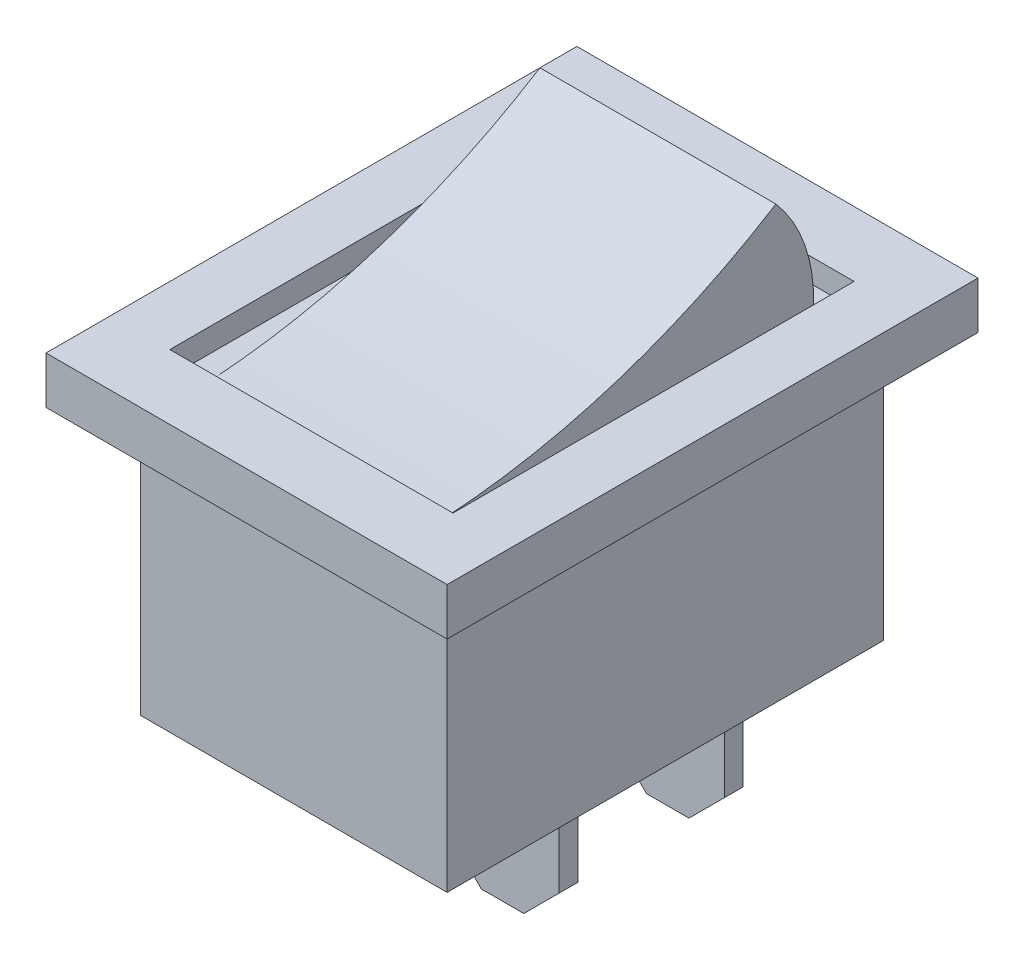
ISO-10303-21;
HEADER;
FILE_DESCRIPTION(('STEP AP214'),'2;1');
FILE_NAME('part.step','',(''),(''),'','','');
FILE_SCHEMA(('AUTOMOTIVE_DESIGN { 1 0 10303 214 1 1 1 1 }'));
ENDSEC;
DATA;
#1=APPLICATION_CONTEXT('core data for automotive mechanical design processes');
#2=APPLICATION_PROTOCOL_DEFINITION('international standard','automotive_design',2000,#1);
#3=PRODUCT_CONTEXT('',#1,'mechanical');
#4=PRODUCT('Part','Part','',(#3));
#5=PRODUCT_RELATED_PRODUCT_CATEGORY('part','',(#4));
#6=PRODUCT_DEFINITION_FORMATION('','',#4);
#7=PRODUCT_DEFINITION_CONTEXT('part definition',#1,'design');
#8=PRODUCT_DEFINITION('design','',#6,#7);
#9=PRODUCT_DEFINITION_SHAPE('','',#8);
#10=(LENGTH_UNIT() NAMED_UNIT(*) SI_UNIT(.MILLI.,.METRE.));
#11=(NAMED_UNIT(*) PLANE_ANGLE_UNIT() SI_UNIT($,.RADIAN.));
#12=(NAMED_UNIT(*) SI_UNIT($,.STERADIAN.) SOLID_ANGLE_UNIT());
#13=UNCERTAINTY_MEASURE_WITH_UNIT(LENGTH_MEASURE(1.E-05),#10,'distance_accuracy_value','');
#14=(GEOMETRIC_REPRESENTATION_CONTEXT(3) GLOBAL_UNCERTAINTY_ASSIGNED_CONTEXT((#13)) GLOBAL_UNIT_ASSIGNED_CONTEXT((#10,
#11,#12)) REPRESENTATION_CONTEXT('',''));
#15=CARTESIAN_POINT('',(0.,0.,0.));
#16=DIRECTION('',(0.,0.,1.));
#17=DIRECTION('',(1.,0.,0.));
#18=AXIS2_PLACEMENT_3D('',#15,#16,#17);
#19=CARTESIAN_POINT('',(-6.49999999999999,0.,9.25));
#20=DIRECTION('',(0.,-1.,0.));
#21=DIRECTION('',(0.,0.,-1.));
#22=AXIS2_PLACEMENT_3D('',#19,#20,#21);
#23=PLANE('',#22);
#24=DIRECTION('',(-1.,0.,0.));
#25=VECTOR('',#24,1.);
#26=CARTESIAN_POINT('',(2.4,0.,0.4));
#27=LINE('',#26,#25);
#28=CARTESIAN_POINT('',(2.4,0.,0.4));
#29=VERTEX_POINT('',#28);
#30=CARTESIAN_POINT('',(-2.4,0.,0.4));
#31=VERTEX_POINT('',#30);
#32=EDGE_CURVE('E263',#29,#31,#27,.T.);
#33=ORIENTED_EDGE('',*,*,#32,.F.);
#34=DIRECTION('',(0.,0.,1.));
#35=VECTOR('',#34,1.);
#36=CARTESIAN_POINT('',(2.4,0.,0.4));
#37=LINE('',#36,#35);
#38=CARTESIAN_POINT('',(2.4,0.,-0.4));
#39=VERTEX_POINT('',#38);
#40=EDGE_CURVE('E227',#39,#29,#37,.T.);
#41=ORIENTED_EDGE('',*,*,#40,.F.);
#42=DIRECTION('',(1.,0.,0.));
#43=VECTOR('',#42,1.);
#44=CARTESIAN_POINT('',(2.4,0.,-0.4));
#45=LINE('',#44,#43);
#46=CARTESIAN_POINT('',(-2.4,0.,-0.399999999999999));
#47=VERTEX_POINT('',#46);
#48=EDGE_CURVE('E257',#47,#39,#45,.T.);
#49=ORIENTED_EDGE('',*,*,#48,.F.);
#50=DIRECTION('',(0.,0.,-1.));
#51=VECTOR('',#50,1.);
#52=CARTESIAN_POINT('',(-2.4,0.,0.4));
#53=LINE('',#52,#51);
#54=EDGE_CURVE('E266',#31,#47,#53,.T.);
#55=ORIENTED_EDGE('',*,*,#54,.F.);
#56=EDGE_LOOP('',(#33,#41,#49,#55));
#57=FACE_BOUND('',#56,.T.);
#58=DIRECTION('',(0.,0.,1.));
#59=VECTOR('',#58,1.);
#60=CARTESIAN_POINT('',(-6.49999999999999,0.,9.25));
#61=LINE('',#60,#59);
#62=CARTESIAN_POINT('',(-6.5,0.,-9.25));
#63=VERTEX_POINT('',#62);
#64=CARTESIAN_POINT('',(-6.49999999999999,0.,9.25));
#65=VERTEX_POINT('',#64);
#66=EDGE_CURVE('E364',#63,#65,#61,.T.);
#67=ORIENTED_EDGE('',*,*,#66,.F.);
#68=DIRECTION('',(-1.,0.,0.));
#69=VECTOR('',#68,1.);
#70=CARTESIAN_POINT('',(-6.5,0.,-9.25));
#71=LINE('',#70,#69);
#72=CARTESIAN_POINT('',(6.5,0.,-9.25));
#73=VERTEX_POINT('',#72);
#74=EDGE_CURVE('E371',#73,#63,#71,.T.);
#75=ORIENTED_EDGE('',*,*,#74,.F.);
#76=DIRECTION('',(0.,0.,-1.));
#77=VECTOR('',#76,1.);
#78=CARTESIAN_POINT('',(6.5,0.,9.25));
#79=LINE('',#78,#77);
#80=CARTESIAN_POINT('',(6.5,0.,9.25));
#81=VERTEX_POINT('',#80);
#82=EDGE_CURVE('E369',#81,#73,#79,.T.);
#83=ORIENTED_EDGE('',*,*,#82,.F.);
#84=DIRECTION('',(1.,0.,0.));
#85=VECTOR('',#84,1.);
#86=CARTESIAN_POINT('',(-6.49999999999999,0.,9.25));
#87=LINE('',#86,#85);
#88=EDGE_CURVE('E367',#65,#81,#87,.T.);
#89=ORIENTED_EDGE('',*,*,#88,.F.);
#90=EDGE_LOOP('',(#67,#75,#83,#89));
#91=FACE_BOUND('',#90,.T.);
#92=DIRECTION('',(-1.,0.,0.));
#93=VECTOR('',#92,1.);
#94=CARTESIAN_POINT('',(2.4,0.,-6.6));
#95=LINE('',#94,#93);
#96=CARTESIAN_POINT('',(2.4,0.,-6.6));
#97=VERTEX_POINT('',#96);
#98=CARTESIAN_POINT('',(-2.4,0.,-6.6));
#99=VERTEX_POINT('',#98);
#100=EDGE_CURVE('E222',#97,#99,#95,.T.);
#101=ORIENTED_EDGE('',*,*,#100,.F.);
#102=DIRECTION('',(0.,0.,1.));
#103=VECTOR('',#102,1.);
#104=CARTESIAN_POINT('',(2.4,0.,-6.6));
#105=LINE('',#104,#103);
#106=CARTESIAN_POINT('',(2.4,0.,-7.4));
#107=VERTEX_POINT('',#106);
#108=EDGE_CURVE('E231',#107,#97,#105,.T.);
#109=ORIENTED_EDGE('',*,*,#108,.F.);
#110=DIRECTION('',(1.,0.,0.));
#111=VECTOR('',#110,1.);
#112=CARTESIAN_POINT('',(2.4,0.,-7.4));
#113=LINE('',#112,#111);
#114=CARTESIAN_POINT('',(-2.4,0.,-7.4));
#115=VERTEX_POINT('',#114);
#116=EDGE_CURVE('E242',#115,#107,#113,.T.);
#117=ORIENTED_EDGE('',*,*,#116,.F.);
#118=DIRECTION('',(0.,0.,-1.));
#119=VECTOR('',#118,1.);
#120=CARTESIAN_POINT('',(-2.4,0.,-6.6));
#121=LINE('',#120,#119);
#122=EDGE_CURVE('E240',#99,#115,#121,.T.);
#123=ORIENTED_EDGE('',*,*,#122,.F.);
#124=EDGE_LOOP('',(#101,#109,#117,#123));
#125=FACE_BOUND('',#124,.T.);
#126=ADVANCED_FACE('F37',(#57,#91,#125),#23,.T.);
#127=CARTESIAN_POINT('',(6.,12.3,8.5));
#128=DIRECTION('',(0.,-1.,0.));
#129=DIRECTION('',(0.,0.,-1.));
#130=AXIS2_PLACEMENT_3D('',#127,#128,#129);
#131=PLANE('',#130);
#132=DIRECTION('',(0.,0.,-1.));
#133=VECTOR('',#132,1.);
#134=CARTESIAN_POINT('',(6.,12.3,-8.5));
#135=LINE('',#134,#133);
#136=CARTESIAN_POINT('',(6.,12.3,8.5));
#137=VERTEX_POINT('',#136);
#138=CARTESIAN_POINT('',(6.,12.3,-8.5));
#139=VERTEX_POINT('',#138);
#140=EDGE_CURVE('E313',#137,#139,#135,.T.);
#141=ORIENTED_EDGE('',*,*,#140,.T.);
#142=DIRECTION('',(-1.,0.,0.));
#143=VECTOR('',#142,1.);
#144=CARTESIAN_POINT('',(6.,12.3,-8.5));
#145=LINE('',#144,#143);
#146=CARTESIAN_POINT('',(-6.,12.3,-8.5));
#147=VERTEX_POINT('',#146);
#148=EDGE_CURVE('E316',#139,#147,#145,.T.);
#149=ORIENTED_EDGE('',*,*,#148,.T.);
#150=DIRECTION('',(0.,0.,1.));
#151=VECTOR('',#150,1.);
#152=CARTESIAN_POINT('',(-6.,12.3,-8.5));
#153=LINE('',#152,#151);
#154=CARTESIAN_POINT('',(-6.,12.3,8.5));
#155=VERTEX_POINT('',#154);
#156=EDGE_CURVE('E319',#147,#155,#153,.T.);
#157=ORIENTED_EDGE('',*,*,#156,.T.);
#158=DIRECTION('',(1.,0.,0.));
#159=VECTOR('',#158,1.);
#160=CARTESIAN_POINT('',(6.,12.3,8.5));
#161=LINE('',#160,#159);
#162=EDGE_CURVE('E322',#155,#137,#161,.T.);
#163=ORIENTED_EDGE('',*,*,#162,.T.);
#164=EDGE_LOOP('',(#141,#149,#157,#163));
#165=FACE_BOUND('',#164,.T.);
#166=DIRECTION('',(0.,0.,-1.));
#167=VECTOR('',#166,1.);
#168=CARTESIAN_POINT('',(-5.,12.3,-7.78111213));
#169=LINE('',#168,#167);
#170=CARTESIAN_POINT('',(-5.,12.3,7.78111213));
#171=VERTEX_POINT('',#170);
#172=CARTESIAN_POINT('',(-5.,12.3,-7.78111213));
#173=VERTEX_POINT('',#172);
#174=EDGE_CURVE('E288',#171,#173,#169,.T.);
#175=ORIENTED_EDGE('',*,*,#174,.T.);
#176=DIRECTION('',(1.,0.,0.));
#177=VECTOR('',#176,1.);
#178=CARTESIAN_POINT('',(-5.,12.3,-7.78111213));
#179=LINE('',#178,#177);
#180=CARTESIAN_POINT('',(5.,12.3,-7.78111213));
#181=VERTEX_POINT('',#180);
#182=EDGE_CURVE('E298',#173,#181,#179,.T.);
#183=ORIENTED_EDGE('',*,*,#182,.T.);
#184=DIRECTION('',(0.,0.,-1.));
#185=VECTOR('',#184,1.);
#186=CARTESIAN_POINT('',(5.,12.3,-7.78111213));
#187=LINE('',#186,#185);
#188=CARTESIAN_POINT('',(5.,12.3,7.78111213));
#189=VERTEX_POINT('',#188);
#190=EDGE_CURVE('E280',#189,#181,#187,.T.);
#191=ORIENTED_EDGE('',*,*,#190,.F.);
#192=DIRECTION('',(1.,0.,0.));
#193=VECTOR('',#192,1.);
#194=CARTESIAN_POINT('',(-5.,12.3,7.78111213));
#195=LINE('',#194,#193);
#196=EDGE_CURVE('E294',#171,#189,#195,.T.);
#197=ORIENTED_EDGE('',*,*,#196,.F.);
#198=EDGE_LOOP('',(#175,#183,#191,#197));
#199=FACE_BOUND('',#198,.T.);
#200=ADVANCED_FACE('F458',(#165,#199),#131,.F.);
#201=CARTESIAN_POINT('',(-6.49999999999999,11.3,9.25));
#202=DIRECTION('',(1.,0.,0.));
#203=DIRECTION('',(0.,0.,-1.));
#204=AXIS2_PLACEMENT_3D('',#201,#202,#203);
#205=PLANE('',#204);
#206=ORIENTED_EDGE('',*,*,#66,.T.);
#207=DIRECTION('',(0.,-1.,0.));
#208=VECTOR('',#207,1.);
#209=CARTESIAN_POINT('',(-6.49999999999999,11.3,9.25));
#210=LINE('',#209,#208);
#211=CARTESIAN_POINT('',(-6.49999999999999,11.3,9.25));
#212=VERTEX_POINT('',#211);
#213=EDGE_CURVE('E394',#212,#65,#210,.T.);
#214=ORIENTED_EDGE('',*,*,#213,.F.);
#215=DIRECTION('',(0.,0.,1.));
#216=VECTOR('',#215,1.);
#217=CARTESIAN_POINT('',(-6.49999999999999,11.3,9.25));
#218=LINE('',#217,#216);
#219=CARTESIAN_POINT('',(-6.5,11.3,-9.25));
#220=VERTEX_POINT('',#219);
#221=EDGE_CURVE('E373',#220,#212,#218,.T.);
#222=ORIENTED_EDGE('',*,*,#221,.F.);
#223=DIRECTION('',(0.,-1.,0.));
#224=VECTOR('',#223,1.);
#225=CARTESIAN_POINT('',(-6.5,11.3,-9.25));
#226=LINE('',#225,#224);
#227=EDGE_CURVE('E385',#220,#63,#226,.T.);
#228=ORIENTED_EDGE('',*,*,#227,.T.);
#229=EDGE_LOOP('',(#206,#214,#222,#228));
#230=FACE_BOUND('',#229,.T.);
#231=ADVANCED_FACE('F463',(#230),#205,.F.);
#232=CARTESIAN_POINT('',(-6.49999999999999,11.3,9.25));
#233=DIRECTION('',(0.,0.,-1.));
#234=DIRECTION('',(-1.,0.,0.));
#235=AXIS2_PLACEMENT_3D('',#232,#233,#234);
#236=PLANE('',#235);
#237=ORIENTED_EDGE('',*,*,#88,.T.);
#238=DIRECTION('',(0.,-1.,0.));
#239=VECTOR('',#238,1.);
#240=CARTESIAN_POINT('',(6.5,11.3,9.25));
#241=LINE('',#240,#239);
#242=CARTESIAN_POINT('',(6.5,11.3,9.25));
#243=VERTEX_POINT('',#242);
#244=EDGE_CURVE('E391',#243,#81,#241,.T.);
#245=ORIENTED_EDGE('',*,*,#244,.F.);
#246=DIRECTION('',(1.,0.,0.));
#247=VECTOR('',#246,1.);
#248=CARTESIAN_POINT('',(-6.49999999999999,11.3,9.25));
#249=LINE('',#248,#247);
#250=EDGE_CURVE('E376',#212,#243,#249,.T.);
#251=ORIENTED_EDGE('',*,*,#250,.F.);
#252=ORIENTED_EDGE('',*,*,#213,.T.);
#253=EDGE_LOOP('',(#237,#245,#251,#252));
#254=FACE_BOUND('',#253,.T.);
#255=ADVANCED_FACE('F478',(#254),#236,.F.);
#256=CARTESIAN_POINT('',(6.5,11.3,9.25));
#257=DIRECTION('',(-1.,0.,0.));
#258=DIRECTION('',(0.,0.,1.));
#259=AXIS2_PLACEMENT_3D('',#256,#257,#258);
#260=PLANE('',#259);
#261=ORIENTED_EDGE('',*,*,#82,.T.);
#262=DIRECTION('',(0.,-1.,0.));
#263=VECTOR('',#262,1.);
#264=CARTESIAN_POINT('',(6.5,11.3,-9.25));
#265=LINE('',#264,#263);
#266=CARTESIAN_POINT('',(6.5,11.3,-9.25));
#267=VERTEX_POINT('',#266);
#268=EDGE_CURVE('E388',#267,#73,#265,.T.);
#269=ORIENTED_EDGE('',*,*,#268,.F.);
#270=DIRECTION('',(0.,0.,-1.));
#271=VECTOR('',#270,1.);
#272=CARTESIAN_POINT('',(6.5,11.3,9.25));
#273=LINE('',#272,#271);
#274=EDGE_CURVE('E379',#243,#267,#273,.T.);
#275=ORIENTED_EDGE('',*,*,#274,.F.);
#276=ORIENTED_EDGE('',*,*,#244,.T.);
#277=EDGE_LOOP('',(#261,#269,#275,#276));
#278=FACE_BOUND('',#277,.T.);
#279=ADVANCED_FACE('F474',(#278),#260,.F.);
#280=CARTESIAN_POINT('',(-6.5,11.3,-9.25));
#281=DIRECTION('',(0.,0.,1.));
#282=DIRECTION('',(1.,0.,0.));
#283=AXIS2_PLACEMENT_3D('',#280,#281,#282);
#284=PLANE('',#283);
#285=ORIENTED_EDGE('',*,*,#74,.T.);
#286=ORIENTED_EDGE('',*,*,#227,.F.);
#287=DIRECTION('',(-1.,0.,0.));
#288=VECTOR('',#287,1.);
#289=CARTESIAN_POINT('',(-6.5,11.3,-9.25));
#290=LINE('',#289,#288);
#291=EDGE_CURVE('E382',#267,#220,#290,.T.);
#292=ORIENTED_EDGE('',*,*,#291,.F.);
#293=ORIENTED_EDGE('',*,*,#268,.T.);
#294=EDGE_LOOP('',(#285,#286,#292,#293));
#295=FACE_BOUND('',#294,.T.);
#296=ADVANCED_FACE('F470',(#295),#284,.F.);
#297=CARTESIAN_POINT('',(8.5,11.3,-11.25));
#298=DIRECTION('',(0.,-1.,0.));
#299=DIRECTION('',(0.,0.,-1.));
#300=AXIS2_PLACEMENT_3D('',#297,#298,#299);
#301=PLANE('',#300);
#302=DIRECTION('',(0.,0.,-1.));
#303=VECTOR('',#302,1.);
#304=CARTESIAN_POINT('',(8.5,11.3,-11.25));
#305=LINE('',#304,#303);
#306=CARTESIAN_POINT('',(8.5,11.3,11.25));
#307=VERTEX_POINT('',#306);
#308=CARTESIAN_POINT('',(8.5,11.3,-11.25));
#309=VERTEX_POINT('',#308);
#310=EDGE_CURVE('E328',#307,#309,#305,.T.);
#311=ORIENTED_EDGE('',*,*,#310,.F.);
#312=DIRECTION('',(1.,0.,0.));
#313=VECTOR('',#312,1.);
#314=CARTESIAN_POINT('',(8.5,11.3,11.25));
#315=LINE('',#314,#313);
#316=CARTESIAN_POINT('',(-8.5,11.3,11.25));
#317=VERTEX_POINT('',#316);
#318=EDGE_CURVE('E341',#317,#307,#315,.T.);
#319=ORIENTED_EDGE('',*,*,#318,.F.);
#320=DIRECTION('',(0.,0.,1.));
#321=VECTOR('',#320,1.);
#322=CARTESIAN_POINT('',(-8.5,11.3,-11.25));
#323=LINE('',#322,#321);
#324=CARTESIAN_POINT('',(-8.5,11.3,-11.25));
#325=VERTEX_POINT('',#324);
#326=EDGE_CURVE('E339',#325,#317,#323,.T.);
#327=ORIENTED_EDGE('',*,*,#326,.F.);
#328=DIRECTION('',(-1.,0.,0.));
#329=VECTOR('',#328,1.);
#330=CARTESIAN_POINT('',(8.5,11.3,-11.25));
#331=LINE('',#330,#329);
#332=EDGE_CURVE('E337',#309,#325,#331,.T.);
#333=ORIENTED_EDGE('',*,*,#332,.F.);
#334=EDGE_LOOP('',(#311,#319,#327,#333));
#335=FACE_BOUND('',#334,.T.);
#336=ORIENTED_EDGE('',*,*,#221,.T.);
#337=ORIENTED_EDGE('',*,*,#250,.T.);
#338=ORIENTED_EDGE('',*,*,#274,.T.);
#339=ORIENTED_EDGE('',*,*,#291,.T.);
#340=EDGE_LOOP('',(#336,#337,#338,#339));
#341=FACE_BOUND('',#340,.T.);
#342=ADVANCED_FACE('F473',(#335,#341),#301,.T.);
#343=CARTESIAN_POINT('',(8.5,13.3,-11.25));
#344=DIRECTION('',(-1.,0.,0.));
#345=DIRECTION('',(0.,0.,1.));
#346=AXIS2_PLACEMENT_3D('',#343,#344,#345);
#347=PLANE('',#346);
#348=ORIENTED_EDGE('',*,*,#310,.T.);
#349=DIRECTION('',(0.,-1.,0.));
#350=VECTOR('',#349,1.);
#351=CARTESIAN_POINT('',(8.5,13.3,-11.25));
#352=LINE('',#351,#350);
#353=CARTESIAN_POINT('',(8.5,13.3,-11.25));
#354=VERTEX_POINT('',#353);
#355=EDGE_CURVE('E361',#354,#309,#352,.T.);
#356=ORIENTED_EDGE('',*,*,#355,.F.);
#357=DIRECTION('',(0.,0.,-1.));
#358=VECTOR('',#357,1.);
#359=CARTESIAN_POINT('',(8.5,13.3,-11.25));
#360=LINE('',#359,#358);
#361=CARTESIAN_POINT('',(8.5,13.3,11.25));
#362=VERTEX_POINT('',#361);
#363=EDGE_CURVE('E343',#362,#354,#360,.T.);
#364=ORIENTED_EDGE('',*,*,#363,.F.);
#365=DIRECTION('',(0.,-1.,0.));
#366=VECTOR('',#365,1.);
#367=CARTESIAN_POINT('',(8.5,13.3,11.25));
#368=LINE('',#367,#366);
#369=EDGE_CURVE('E352',#362,#307,#368,.T.);
#370=ORIENTED_EDGE('',*,*,#369,.T.);
#371=EDGE_LOOP('',(#348,#356,#364,#370));
#372=FACE_BOUND('',#371,.T.);
#373=ADVANCED_FACE('F468',(#372),#347,.F.);
#374=CARTESIAN_POINT('',(8.5,13.3,-11.25));
#375=DIRECTION('',(0.,0.,1.));
#376=DIRECTION('',(1.,0.,0.));
#377=AXIS2_PLACEMENT_3D('',#374,#375,#376);
#378=PLANE('',#377);
#379=ORIENTED_EDGE('',*,*,#332,.T.);
#380=DIRECTION('',(0.,-1.,0.));
#381=VECTOR('',#380,1.);
#382=CARTESIAN_POINT('',(-8.5,13.3,-11.25));
#383=LINE('',#382,#381);
#384=CARTESIAN_POINT('',(-8.5,13.3,-11.25));
#385=VERTEX_POINT('',#384);
#386=EDGE_CURVE('E358',#385,#325,#383,.T.);
#387=ORIENTED_EDGE('',*,*,#386,.F.);
#388=DIRECTION('',(-1.,0.,0.));
#389=VECTOR('',#388,1.);
#390=CARTESIAN_POINT('',(8.5,13.3,-11.25));
#391=LINE('',#390,#389);
#392=EDGE_CURVE('E346',#354,#385,#391,.T.);
#393=ORIENTED_EDGE('',*,*,#392,.F.);
#394=ORIENTED_EDGE('',*,*,#355,.T.);
#395=EDGE_LOOP('',(#379,#387,#393,#394));
#396=FACE_BOUND('',#395,.T.);
#397=ADVANCED_FACE('F715',(#396),#378,.F.);
#398=CARTESIAN_POINT('',(-8.5,13.3,-11.25));
#399=DIRECTION('',(1.,0.,0.));
#400=DIRECTION('',(0.,0.,-1.));
#401=AXIS2_PLACEMENT_3D('',#398,#399,#400);
#402=PLANE('',#401);
#403=ORIENTED_EDGE('',*,*,#326,.T.);
#404=DIRECTION('',(0.,-1.,0.));
#405=VECTOR('',#404,1.);
#406=CARTESIAN_POINT('',(-8.5,13.3,11.25));
#407=LINE('',#406,#405);
#408=CARTESIAN_POINT('',(-8.5,13.3,11.25));
#409=VERTEX_POINT('',#408);
#410=EDGE_CURVE('E355',#409,#317,#407,.T.);
#411=ORIENTED_EDGE('',*,*,#410,.F.);
#412=DIRECTION('',(0.,0.,1.));
#413=VECTOR('',#412,1.);
#414=CARTESIAN_POINT('',(-8.5,13.3,-11.25));
#415=LINE('',#414,#413);
#416=EDGE_CURVE('E348',#385,#409,#415,.T.);
#417=ORIENTED_EDGE('',*,*,#416,.F.);
#418=ORIENTED_EDGE('',*,*,#386,.T.);
#419=EDGE_LOOP('',(#403,#411,#417,#418));
#420=FACE_BOUND('',#419,.T.);
#421=ADVANCED_FACE('F705',(#420),#402,.F.);
#422=CARTESIAN_POINT('',(8.5,13.3,11.25));
#423=DIRECTION('',(0.,0.,-1.));
#424=DIRECTION('',(-1.,0.,0.));
#425=AXIS2_PLACEMENT_3D('',#422,#423,#424);
#426=PLANE('',#425);
#427=ORIENTED_EDGE('',*,*,#318,.T.);
#428=ORIENTED_EDGE('',*,*,#369,.F.);
#429=DIRECTION('',(1.,0.,0.));
#430=VECTOR('',#429,1.);
#431=CARTESIAN_POINT('',(8.5,13.3,11.25));
#432=LINE('',#431,#430);
#433=EDGE_CURVE('E350',#409,#362,#432,.T.);
#434=ORIENTED_EDGE('',*,*,#433,.F.);
#435=ORIENTED_EDGE('',*,*,#410,.T.);
#436=EDGE_LOOP('',(#427,#428,#434,#435));
#437=FACE_BOUND('',#436,.T.);
#438=ADVANCED_FACE('F695',(#437),#426,.F.);
#439=CARTESIAN_POINT('',(8.5,13.3,-11.25));
#440=DIRECTION('',(0.,-1.,0.));
#441=DIRECTION('',(0.,0.,-1.));
#442=AXIS2_PLACEMENT_3D('',#439,#440,#441);
#443=PLANE('',#442);
#444=DIRECTION('',(-1.,0.,0.));
#445=VECTOR('',#444,1.);
#446=CARTESIAN_POINT('',(6.,13.3,-8.5));
#447=LINE('',#446,#445);
#448=CARTESIAN_POINT('',(6.,13.3,-8.5));
#449=VERTEX_POINT('',#448);
#450=CARTESIAN_POINT('',(-6.,13.3,-8.5));
#451=VERTEX_POINT('',#450);
#452=EDGE_CURVE('E304',#449,#451,#447,.T.);
#453=ORIENTED_EDGE('',*,*,#452,.F.);
#454=DIRECTION('',(0.,0.,-1.));
#455=VECTOR('',#454,1.);
#456=CARTESIAN_POINT('',(6.,13.3,-8.5));
#457=LINE('',#456,#455);
#458=CARTESIAN_POINT('',(6.,13.3,8.5));
#459=VERTEX_POINT('',#458);
#460=EDGE_CURVE('E297',#459,#449,#457,.T.);
#461=ORIENTED_EDGE('',*,*,#460,.F.);
#462=DIRECTION('',(1.,0.,0.));
#463=VECTOR('',#462,1.);
#464=CARTESIAN_POINT('',(6.,13.3,8.5));
#465=LINE('',#464,#463);
#466=CARTESIAN_POINT('',(-6.,13.3,8.5));
#467=VERTEX_POINT('',#466);
#468=EDGE_CURVE('E310',#467,#459,#465,.T.);
#469=ORIENTED_EDGE('',*,*,#468,.F.);
#470=DIRECTION('',(0.,0.,1.));
#471=VECTOR('',#470,1.);
#472=CARTESIAN_POINT('',(-6.,13.3,-8.5));
#473=LINE('',#472,#471);
#474=EDGE_CURVE('E307',#451,#467,#473,.T.);
#475=ORIENTED_EDGE('',*,*,#474,.F.);
#476=EDGE_LOOP('',(#453,#461,#469,#475));
#477=FACE_BOUND('',#476,.T.);
#478=ORIENTED_EDGE('',*,*,#363,.T.);
#479=ORIENTED_EDGE('',*,*,#392,.T.);
#480=ORIENTED_EDGE('',*,*,#416,.T.);
#481=ORIENTED_EDGE('',*,*,#433,.T.);
#482=EDGE_LOOP('',(#478,#479,#480,#481));
#483=FACE_BOUND('',#482,.T.);
#484=ADVANCED_FACE('F685',(#477,#483),#443,.F.);
#485=CARTESIAN_POINT('',(6.,12.3,-8.5));
#486=DIRECTION('',(1.,0.,0.));
#487=DIRECTION('',(0.,0.,-1.));
#488=AXIS2_PLACEMENT_3D('',#485,#486,#487);
#489=PLANE('',#488);
#490=ORIENTED_EDGE('',*,*,#460,.T.);
#491=DIRECTION('',(0.,1.,0.));
#492=VECTOR('',#491,1.);
#493=CARTESIAN_POINT('',(6.,12.3,-8.5));
#494=LINE('',#493,#492);
#495=EDGE_CURVE('E325',#139,#449,#494,.T.);
#496=ORIENTED_EDGE('',*,*,#495,.F.);
#497=ORIENTED_EDGE('',*,*,#140,.F.);
#498=DIRECTION('',(0.,1.,0.));
#499=VECTOR('',#498,1.);
#500=CARTESIAN_POINT('',(6.,12.3,8.5));
#501=LINE('',#500,#499);
#502=EDGE_CURVE('E326',#137,#459,#501,.T.);
#503=ORIENTED_EDGE('',*,*,#502,.T.);
#504=EDGE_LOOP('',(#490,#496,#497,#503));
#505=FACE_BOUND('',#504,.T.);
#506=ADVANCED_FACE('F675',(#505),#489,.F.);
#507=CARTESIAN_POINT('',(6.,12.3,8.5));
#508=DIRECTION('',(0.,0.,1.));
#509=DIRECTION('',(1.,0.,0.));
#510=AXIS2_PLACEMENT_3D('',#507,#508,#509);
#511=PLANE('',#510);
#512=ORIENTED_EDGE('',*,*,#468,.T.);
#513=ORIENTED_EDGE('',*,*,#502,.F.);
#514=ORIENTED_EDGE('',*,*,#162,.F.);
#515=DIRECTION('',(0.,1.,0.));
#516=VECTOR('',#515,1.);
#517=CARTESIAN_POINT('',(-6.,12.3,8.5));
#518=LINE('',#517,#516);
#519=EDGE_CURVE('E329',#155,#467,#518,.T.);
#520=ORIENTED_EDGE('',*,*,#519,.T.);
#521=EDGE_LOOP('',(#512,#513,#514,#520));
#522=FACE_BOUND('',#521,.T.);
#523=ADVANCED_FACE('F665',(#522),#511,.F.);
#524=CARTESIAN_POINT('',(-6.,12.3,-8.5));
#525=DIRECTION('',(-1.,0.,0.));
#526=DIRECTION('',(0.,0.,1.));
#527=AXIS2_PLACEMENT_3D('',#524,#525,#526);
#528=PLANE('',#527);
#529=ORIENTED_EDGE('',*,*,#474,.T.);
#530=ORIENTED_EDGE('',*,*,#519,.F.);
#531=ORIENTED_EDGE('',*,*,#156,.F.);
#532=DIRECTION('',(0.,1.,0.));
#533=VECTOR('',#532,1.);
#534=CARTESIAN_POINT('',(-6.,12.3,-8.5));
#535=LINE('',#534,#533);
#536=EDGE_CURVE('E331',#147,#451,#535,.T.);
#537=ORIENTED_EDGE('',*,*,#536,.T.);
#538=EDGE_LOOP('',(#529,#530,#531,#537));
#539=FACE_BOUND('',#538,.T.);
#540=ADVANCED_FACE('F655',(#539),#528,.F.);
#541=CARTESIAN_POINT('',(6.,12.3,-8.5));
#542=DIRECTION('',(0.,0.,-1.));
#543=DIRECTION('',(-1.,0.,0.));
#544=AXIS2_PLACEMENT_3D('',#541,#542,#543);
#545=PLANE('',#544);
#546=ORIENTED_EDGE('',*,*,#452,.T.);
#547=ORIENTED_EDGE('',*,*,#536,.F.);
#548=ORIENTED_EDGE('',*,*,#148,.F.);
#549=ORIENTED_EDGE('',*,*,#495,.T.);
#550=EDGE_LOOP('',(#546,#547,#548,#549));
#551=FACE_BOUND('',#550,.T.);
#552=ADVANCED_FACE('F638',(#551),#545,.F.);
#553=CARTESIAN_POINT('',(-5.,42.2372757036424,9.72006118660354));
#554=DIRECTION('',(1.,0.,0.));
#555=DIRECTION('',(0.,0.,-1.));
#556=AXIS2_PLACEMENT_3D('',#553,#554,#555);
#557=CYLINDRICAL_SURFACE('',#556,30.);
#558=CARTESIAN_POINT('',(5.,42.2372757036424,9.72006118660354));
#559=DIRECTION('',(-1.,0.,0.));
#560=DIRECTION('',(0.,0.,-1.));
#561=AXIS2_PLACEMENT_3D('',#558,#559,#560);
#562=CIRCLE('',#561,30.);
#563=CARTESIAN_POINT('',(5.,16.8,-6.18418368));
#564=VERTEX_POINT('',#563);
#565=EDGE_CURVE('E278',#564,#189,#562,.T.);
#566=ORIENTED_EDGE('',*,*,#565,.F.);
#567=DIRECTION('',(1.,0.,0.));
#568=VECTOR('',#567,1.);
#569=CARTESIAN_POINT('',(-5.,16.8,-6.18418368));
#570=LINE('',#569,#568);
#571=CARTESIAN_POINT('',(-5.,16.8,-6.18418368));
#572=VERTEX_POINT('',#571);
#573=EDGE_CURVE('E295',#572,#564,#570,.T.);
#574=ORIENTED_EDGE('',*,*,#573,.F.);
#575=CARTESIAN_POINT('',(-5.,42.2372757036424,9.72006118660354));
#576=DIRECTION('',(-1.,0.,0.));
#577=DIRECTION('',(0.,0.,-1.));
#578=AXIS2_PLACEMENT_3D('',#575,#576,#577);
#579=CIRCLE('',#578,30.);
#580=EDGE_CURVE('E285',#572,#171,#579,.T.);
#581=ORIENTED_EDGE('',*,*,#580,.T.);
#582=ORIENTED_EDGE('',*,*,#196,.T.);
#583=EDGE_LOOP('',(#566,#574,#581,#582));
#584=FACE_BOUND('',#583,.T.);
#585=ADVANCED_FACE('F627',(#584),#557,.F.);
#586=CARTESIAN_POINT('',(-5.,12.4921848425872,-1.18391083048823));
#587=DIRECTION('',(1.,0.,0.));
#588=DIRECTION('',(0.,0.,-1.));
#589=AXIS2_PLACEMENT_3D('',#586,#587,#588);
#590=CYLINDRICAL_SURFACE('',#589,6.6);
#591=CARTESIAN_POINT('',(5.,12.4921848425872,-1.18391083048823));
#592=DIRECTION('',(1.,0.,0.));
#593=DIRECTION('',(0.,0.,1.));
#594=AXIS2_PLACEMENT_3D('',#591,#592,#593);
#595=CIRCLE('',#594,6.6);
#596=EDGE_CURVE('E282',#181,#564,#595,.T.);
#597=ORIENTED_EDGE('',*,*,#596,.F.);
#598=ORIENTED_EDGE('',*,*,#182,.F.);
#599=CARTESIAN_POINT('',(-5.,12.4921848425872,-1.18391083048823));
#600=DIRECTION('',(1.,0.,0.));
#601=DIRECTION('',(0.,0.,1.));
#602=AXIS2_PLACEMENT_3D('',#599,#600,#601);
#603=CIRCLE('',#602,6.6);
#604=EDGE_CURVE('E291',#173,#572,#603,.T.);
#605=ORIENTED_EDGE('',*,*,#604,.T.);
#606=ORIENTED_EDGE('',*,*,#573,.T.);
#607=EDGE_LOOP('',(#597,#598,#605,#606));
#608=FACE_BOUND('',#607,.T.);
#609=ADVANCED_FACE('F617',(#608),#590,.T.);
#610=CARTESIAN_POINT('',(-5.,42.2372757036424,9.72006118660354));
#611=DIRECTION('',(1.,0.,0.));
#612=DIRECTION('',(0.,0.,-1.));
#613=AXIS2_PLACEMENT_3D('',#610,#611,#612);
#614=PLANE('',#613);
#615=ORIENTED_EDGE('',*,*,#580,.F.);
#616=ORIENTED_EDGE('',*,*,#604,.F.);
#617=ORIENTED_EDGE('',*,*,#174,.F.);
#618=EDGE_LOOP('',(#615,#616,#617));
#619=FACE_BOUND('',#618,.T.);
#620=ADVANCED_FACE('F607',(#619),#614,.F.);
#621=CARTESIAN_POINT('',(5.,42.2372757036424,9.72006118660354));
#622=DIRECTION('',(1.,0.,0.));
#623=DIRECTION('',(0.,0.,-1.));
#624=AXIS2_PLACEMENT_3D('',#621,#622,#623);
#625=PLANE('',#624);
#626=ORIENTED_EDGE('',*,*,#565,.T.);
#627=ORIENTED_EDGE('',*,*,#190,.T.);
#628=ORIENTED_EDGE('',*,*,#596,.T.);
#629=EDGE_LOOP('',(#626,#627,#628));
#630=FACE_BOUND('',#629,.T.);
#631=ADVANCED_FACE('F593',(#630),#625,.T.);
#632=CARTESIAN_POINT('',(2.4,-8.,0.4));
#633=DIRECTION('',(-1.,0.,0.));
#634=DIRECTION('',(0.,0.,1.));
#635=AXIS2_PLACEMENT_3D('',#632,#633,#634);
#636=PLANE('',#635);
#637=DIRECTION('',(0.,1.,0.));
#638=VECTOR('',#637,1.);
#639=CARTESIAN_POINT('',(2.4,-8.,0.4));
#640=LINE('',#639,#638);
#641=CARTESIAN_POINT('',(2.4,-6.49999999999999,0.4));
#642=VERTEX_POINT('',#641);
#643=EDGE_CURVE('E276',#642,#29,#640,.T.);
#644=ORIENTED_EDGE('',*,*,#643,.F.);
#645=DIRECTION('',(0.,0.,-1.));
#646=VECTOR('',#645,1.);
#647=CARTESIAN_POINT('',(2.4,-6.49999999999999,0.4));
#648=LINE('',#647,#646);
#649=CARTESIAN_POINT('',(2.4,-6.49999999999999,-0.4));
#650=VERTEX_POINT('',#649);
#651=EDGE_CURVE('E60',#642,#650,#648,.T.);
#652=ORIENTED_EDGE('',*,*,#651,.T.);
#653=DIRECTION('',(0.,1.,0.));
#654=VECTOR('',#653,1.);
#655=CARTESIAN_POINT('',(2.4,-8.,-0.4));
#656=LINE('',#655,#654);
#657=EDGE_CURVE('E260',#650,#39,#656,.T.);
#658=ORIENTED_EDGE('',*,*,#657,.T.);
#659=ORIENTED_EDGE('',*,*,#40,.T.);
#660=EDGE_LOOP('',(#644,#652,#658,#659));
#661=FACE_BOUND('',#660,.T.);
#662=ADVANCED_FACE('F436',(#661),#636,.F.);
#663=CARTESIAN_POINT('',(2.4,-8.,0.4));
#664=DIRECTION('',(0.,0.,-1.));
#665=DIRECTION('',(-1.,0.,0.));
#666=AXIS2_PLACEMENT_3D('',#663,#664,#665);
#667=PLANE('',#666);
#668=DIRECTION('',(-1.,0.,0.));
#669=VECTOR('',#668,1.);
#670=CARTESIAN_POINT('',(2.4,-8.,0.4));
#671=LINE('',#670,#669);
#672=CARTESIAN_POINT('',(0.899999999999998,-8.,0.4));
#673=VERTEX_POINT('',#672);
#674=CARTESIAN_POINT('',(-0.899999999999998,-8.,0.4));
#675=VERTEX_POINT('',#674);
#676=EDGE_CURVE('E253',#673,#675,#671,.T.);
#677=ORIENTED_EDGE('',*,*,#676,.F.);
#678=DIRECTION('',(-0.707106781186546,-0.707106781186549,0.));
#679=VECTOR('',#678,1.);
#680=CARTESIAN_POINT('',(0.899999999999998,-8.,0.4));
#681=LINE('',#680,#679);
#682=EDGE_CURVE('E422',#673,#642,#681,.F.);
#683=ORIENTED_EDGE('',*,*,#682,.T.);
#684=ORIENTED_EDGE('',*,*,#643,.T.);
#685=ORIENTED_EDGE('',*,*,#32,.T.);
#686=DIRECTION('',(0.,1.,0.));
#687=VECTOR('',#686,1.);
#688=CARTESIAN_POINT('',(-2.4,-8.,0.4));
#689=LINE('',#688,#687);
#690=CARTESIAN_POINT('',(-2.4,-6.49999999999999,0.4));
#691=VERTEX_POINT('',#690);
#692=EDGE_CURVE('E274',#691,#31,#689,.T.);
#693=ORIENTED_EDGE('',*,*,#692,.F.);
#694=DIRECTION('',(-0.707106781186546,0.707106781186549,0.));
#695=VECTOR('',#694,1.);
#696=CARTESIAN_POINT('',(-0.899999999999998,-8.,0.4));
#697=LINE('',#696,#695);
#698=EDGE_CURVE('E420',#691,#675,#697,.F.);
#699=ORIENTED_EDGE('',*,*,#698,.T.);
#700=EDGE_LOOP('',(#677,#683,#684,#685,#693,#699));
#701=FACE_BOUND('',#700,.T.);
#702=ADVANCED_FACE('F435',(#701),#667,.F.);
#703=CARTESIAN_POINT('',(-2.4,-8.,0.4));
#704=DIRECTION('',(1.,0.,0.));
#705=DIRECTION('',(0.,0.,-1.));
#706=AXIS2_PLACEMENT_3D('',#703,#704,#705);
#707=PLANE('',#706);
#708=DIRECTION('',(0.,1.,0.));
#709=VECTOR('',#708,1.);
#710=CARTESIAN_POINT('',(-2.4,-8.,-0.4));
#711=LINE('',#710,#709);
#712=CARTESIAN_POINT('',(-2.4,-6.49999999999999,-0.4));
#713=VERTEX_POINT('',#712);
#714=EDGE_CURVE('E272',#713,#47,#711,.T.);
#715=ORIENTED_EDGE('',*,*,#714,.F.);
#716=DIRECTION('',(0.,0.,1.));
#717=VECTOR('',#716,1.);
#718=CARTESIAN_POINT('',(-2.4,-6.49999999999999,0.4));
#719=LINE('',#718,#717);
#720=EDGE_CURVE('E11',#713,#691,#719,.T.);
#721=ORIENTED_EDGE('',*,*,#720,.T.);
#722=ORIENTED_EDGE('',*,*,#692,.T.);
#723=ORIENTED_EDGE('',*,*,#54,.T.);
#724=EDGE_LOOP('',(#715,#721,#722,#723));
#725=FACE_BOUND('',#724,.T.);
#726=ADVANCED_FACE('F448',(#725),#707,.F.);
#727=CARTESIAN_POINT('',(2.4,-8.,-0.4));
#728=DIRECTION('',(0.,0.,1.));
#729=DIRECTION('',(1.,0.,0.));
#730=AXIS2_PLACEMENT_3D('',#727,#728,#729);
#731=PLANE('',#730);
#732=ORIENTED_EDGE('',*,*,#657,.F.);
#733=DIRECTION('',(0.707106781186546,0.707106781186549,0.));
#734=VECTOR('',#733,1.);
#735=CARTESIAN_POINT('',(0.899999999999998,-8.,-0.4));
#736=LINE('',#735,#734);
#737=CARTESIAN_POINT('',(0.899999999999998,-8.,-0.4));
#738=VERTEX_POINT('',#737);
#739=EDGE_CURVE('E45',#650,#738,#736,.F.);
#740=ORIENTED_EDGE('',*,*,#739,.T.);
#741=DIRECTION('',(1.,0.,0.));
#742=VECTOR('',#741,1.);
#743=CARTESIAN_POINT('',(2.4,-8.,-0.4));
#744=LINE('',#743,#742);
#745=CARTESIAN_POINT('',(-0.899999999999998,-8.,-0.4));
#746=VERTEX_POINT('',#745);
#747=EDGE_CURVE('E256',#746,#738,#744,.T.);
#748=ORIENTED_EDGE('',*,*,#747,.F.);
#749=DIRECTION('',(0.707106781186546,-0.707106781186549,0.));
#750=VECTOR('',#749,1.);
#751=CARTESIAN_POINT('',(-0.899999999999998,-8.,-0.4));
#752=LINE('',#751,#750);
#753=EDGE_CURVE('E52',#746,#713,#752,.F.);
#754=ORIENTED_EDGE('',*,*,#753,.T.);
#755=ORIENTED_EDGE('',*,*,#714,.T.);
#756=ORIENTED_EDGE('',*,*,#48,.T.);
#757=EDGE_LOOP('',(#732,#740,#748,#754,#755,#756));
#758=FACE_BOUND('',#757,.T.);
#759=ADVANCED_FACE('F426',(#758),#731,.F.);
#760=CARTESIAN_POINT('',(2.4,-8.,-0.4));
#761=DIRECTION('',(0.,1.,0.));
#762=DIRECTION('',(0.,0.,1.));
#763=AXIS2_PLACEMENT_3D('',#760,#761,#762);
#764=PLANE('',#763);
#765=ORIENTED_EDGE('',*,*,#747,.T.);
#766=DIRECTION('',(0.,0.,1.));
#767=VECTOR('',#766,1.);
#768=CARTESIAN_POINT('',(0.899999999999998,-8.,-0.4));
#769=LINE('',#768,#767);
#770=EDGE_CURVE('E417',#738,#673,#769,.T.);
#771=ORIENTED_EDGE('',*,*,#770,.T.);
#772=ORIENTED_EDGE('',*,*,#676,.T.);
#773=DIRECTION('',(0.,0.,-1.));
#774=VECTOR('',#773,1.);
#775=CARTESIAN_POINT('',(-0.899999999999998,-8.,-0.4));
#776=LINE('',#775,#774);
#777=EDGE_CURVE('E414',#675,#746,#776,.T.);
#778=ORIENTED_EDGE('',*,*,#777,.T.);
#779=EDGE_LOOP('',(#765,#771,#772,#778));
#780=FACE_BOUND('',#779,.T.);
#781=ADVANCED_FACE('F430',(#780),#764,.F.);
#782=CARTESIAN_POINT('',(2.4,-8.,-6.6));
#783=DIRECTION('',(-1.,0.,0.));
#784=DIRECTION('',(0.,0.,1.));
#785=AXIS2_PLACEMENT_3D('',#782,#783,#784);
#786=PLANE('',#785);
#787=DIRECTION('',(0.,1.,0.));
#788=VECTOR('',#787,1.);
#789=CARTESIAN_POINT('',(2.4,-8.,-6.6));
#790=LINE('',#789,#788);
#791=CARTESIAN_POINT('',(2.4,-6.49999999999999,-6.6));
#792=VERTEX_POINT('',#791);
#793=EDGE_CURVE('E216',#792,#97,#790,.T.);
#794=ORIENTED_EDGE('',*,*,#793,.F.);
#795=DIRECTION('',(0.,0.,-1.));
#796=VECTOR('',#795,1.);
#797=CARTESIAN_POINT('',(2.4,-6.49999999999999,-6.6));
#798=LINE('',#797,#796);
#799=CARTESIAN_POINT('',(2.4,-6.49999999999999,-7.4));
#800=VERTEX_POINT('',#799);
#801=EDGE_CURVE('E406',#792,#800,#798,.T.);
#802=ORIENTED_EDGE('',*,*,#801,.T.);
#803=DIRECTION('',(0.,1.,0.));
#804=VECTOR('',#803,1.);
#805=CARTESIAN_POINT('',(2.4,-8.,-7.4));
#806=LINE('',#805,#804);
#807=EDGE_CURVE('E234',#800,#107,#806,.T.);
#808=ORIENTED_EDGE('',*,*,#807,.T.);
#809=ORIENTED_EDGE('',*,*,#108,.T.);
#810=EDGE_LOOP('',(#794,#802,#808,#809));
#811=FACE_BOUND('',#810,.T.);
#812=ADVANCED_FACE('F232',(#811),#786,.F.);
#813=CARTESIAN_POINT('',(2.4,-8.,-6.6));
#814=DIRECTION('',(0.,0.,-1.));
#815=DIRECTION('',(-1.,0.,0.));
#816=AXIS2_PLACEMENT_3D('',#813,#814,#815);
#817=PLANE('',#816);
#818=DIRECTION('',(-1.,0.,0.));
#819=VECTOR('',#818,1.);
#820=CARTESIAN_POINT('',(2.4,-8.,-6.6));
#821=LINE('',#820,#819);
#822=CARTESIAN_POINT('',(0.899999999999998,-8.,-6.6));
#823=VERTEX_POINT('',#822);
#824=CARTESIAN_POINT('',(-0.899999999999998,-8.,-6.6));
#825=VERTEX_POINT('',#824);
#826=EDGE_CURVE('E247',#823,#825,#821,.T.);
#827=ORIENTED_EDGE('',*,*,#826,.F.);
#828=DIRECTION('',(-0.707106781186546,-0.707106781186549,0.));
#829=VECTOR('',#828,1.);
#830=CARTESIAN_POINT('',(0.899999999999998,-8.,-6.6));
#831=LINE('',#830,#829);
#832=EDGE_CURVE('E224',#823,#792,#831,.F.);
#833=ORIENTED_EDGE('',*,*,#832,.T.);
#834=ORIENTED_EDGE('',*,*,#793,.T.);
#835=ORIENTED_EDGE('',*,*,#100,.T.);
#836=DIRECTION('',(0.,1.,0.));
#837=VECTOR('',#836,1.);
#838=CARTESIAN_POINT('',(-2.4,-8.,-6.6));
#839=LINE('',#838,#837);
#840=CARTESIAN_POINT('',(-2.4,-6.49999999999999,-6.6));
#841=VERTEX_POINT('',#840);
#842=EDGE_CURVE('E228',#841,#99,#839,.T.);
#843=ORIENTED_EDGE('',*,*,#842,.F.);
#844=DIRECTION('',(-0.707106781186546,0.707106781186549,0.));
#845=VECTOR('',#844,1.);
#846=CARTESIAN_POINT('',(-0.899999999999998,-8.,-6.6));
#847=LINE('',#846,#845);
#848=EDGE_CURVE('E403',#841,#825,#847,.F.);
#849=ORIENTED_EDGE('',*,*,#848,.T.);
#850=EDGE_LOOP('',(#827,#833,#834,#835,#843,#849));
#851=FACE_BOUND('',#850,.T.);
#852=ADVANCED_FACE('F219',(#851),#817,.F.);
#853=CARTESIAN_POINT('',(-2.4,-8.,-6.6));
#854=DIRECTION('',(1.,0.,0.));
#855=DIRECTION('',(0.,0.,-1.));
#856=AXIS2_PLACEMENT_3D('',#853,#854,#855);
#857=PLANE('',#856);
#858=DIRECTION('',(0.,1.,0.));
#859=VECTOR('',#858,1.);
#860=CARTESIAN_POINT('',(-2.4,-8.,-7.4));
#861=LINE('',#860,#859);
#862=CARTESIAN_POINT('',(-2.4,-6.49999999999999,-7.4));
#863=VERTEX_POINT('',#862);
#864=EDGE_CURVE('E249',#863,#115,#861,.T.);
#865=ORIENTED_EDGE('',*,*,#864,.F.);
#866=DIRECTION('',(0.,0.,1.));
#867=VECTOR('',#866,1.);
#868=CARTESIAN_POINT('',(-2.4,-6.49999999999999,-6.6));
#869=LINE('',#868,#867);
#870=EDGE_CURVE('E412',#863,#841,#869,.T.);
#871=ORIENTED_EDGE('',*,*,#870,.T.);
#872=ORIENTED_EDGE('',*,*,#842,.T.);
#873=ORIENTED_EDGE('',*,*,#122,.T.);
#874=EDGE_LOOP('',(#865,#871,#872,#873));
#875=FACE_BOUND('',#874,.T.);
#876=ADVANCED_FACE('F535',(#875),#857,.F.);
#877=CARTESIAN_POINT('',(2.4,-8.,-7.4));
#878=DIRECTION('',(0.,0.,1.));
#879=DIRECTION('',(1.,0.,0.));
#880=AXIS2_PLACEMENT_3D('',#877,#878,#879);
#881=PLANE('',#880);
#882=ORIENTED_EDGE('',*,*,#807,.F.);
#883=DIRECTION('',(0.707106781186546,0.707106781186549,0.));
#884=VECTOR('',#883,1.);
#885=CARTESIAN_POINT('',(0.899999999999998,-8.,-7.4));
#886=LINE('',#885,#884);
#887=CARTESIAN_POINT('',(0.899999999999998,-8.,-7.4));
#888=VERTEX_POINT('',#887);
#889=EDGE_CURVE('E410',#800,#888,#886,.F.);
#890=ORIENTED_EDGE('',*,*,#889,.T.);
#891=DIRECTION('',(1.,0.,0.));
#892=VECTOR('',#891,1.);
#893=CARTESIAN_POINT('',(2.4,-8.,-7.4));
#894=LINE('',#893,#892);
#895=CARTESIAN_POINT('',(-0.899999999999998,-8.,-7.4));
#896=VERTEX_POINT('',#895);
#897=EDGE_CURVE('E250',#896,#888,#894,.T.);
#898=ORIENTED_EDGE('',*,*,#897,.F.);
#899=DIRECTION('',(0.707106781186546,-0.707106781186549,0.));
#900=VECTOR('',#899,1.);
#901=CARTESIAN_POINT('',(-0.899999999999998,-8.,-7.4));
#902=LINE('',#901,#900);
#903=EDGE_CURVE('E408',#896,#863,#902,.F.);
#904=ORIENTED_EDGE('',*,*,#903,.T.);
#905=ORIENTED_EDGE('',*,*,#864,.T.);
#906=ORIENTED_EDGE('',*,*,#116,.T.);
#907=EDGE_LOOP('',(#882,#890,#898,#904,#905,#906));
#908=FACE_BOUND('',#907,.T.);
#909=ADVANCED_FACE('F525',(#908),#881,.F.);
#910=CARTESIAN_POINT('',(2.4,-8.,-7.4));
#911=DIRECTION('',(0.,1.,0.));
#912=DIRECTION('',(0.,0.,1.));
#913=AXIS2_PLACEMENT_3D('',#910,#911,#912);
#914=PLANE('',#913);
#915=ORIENTED_EDGE('',*,*,#897,.T.);
#916=DIRECTION('',(0.,0.,1.));
#917=VECTOR('',#916,1.);
#918=CARTESIAN_POINT('',(0.899999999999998,-8.,-7.4));
#919=LINE('',#918,#917);
#920=EDGE_CURVE('E400',#888,#823,#919,.T.);
#921=ORIENTED_EDGE('',*,*,#920,.T.);
#922=ORIENTED_EDGE('',*,*,#826,.T.);
#923=DIRECTION('',(0.,0.,-1.));
#924=VECTOR('',#923,1.);
#925=CARTESIAN_POINT('',(-0.899999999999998,-8.,-7.4));
#926=LINE('',#925,#924);
#927=EDGE_CURVE('E397',#825,#896,#926,.T.);
#928=ORIENTED_EDGE('',*,*,#927,.T.);
#929=EDGE_LOOP('',(#915,#921,#922,#928));
#930=FACE_BOUND('',#929,.T.);
#931=ADVANCED_FACE('F490',(#930),#914,.F.);
#932=CARTESIAN_POINT('',(0.899999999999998,-8.,-7.4));
#933=DIRECTION('',(-0.707106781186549,0.707106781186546,0.));
#934=DIRECTION('',(-0.707106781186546,-0.707106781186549,0.));
#935=AXIS2_PLACEMENT_3D('',#932,#933,#934);
#936=PLANE('',#935);
#937=ORIENTED_EDGE('',*,*,#889,.F.);
#938=ORIENTED_EDGE('',*,*,#801,.F.);
#939=ORIENTED_EDGE('',*,*,#832,.F.);
#940=ORIENTED_EDGE('',*,*,#920,.F.);
#941=EDGE_LOOP('',(#937,#938,#939,#940));
#942=FACE_BOUND('',#941,.T.);
#943=ADVANCED_FACE('F486',(#942),#936,.F.);
#944=CARTESIAN_POINT('',(-0.899999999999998,-8.,-7.4));
#945=DIRECTION('',(0.707106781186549,0.707106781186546,0.));
#946=DIRECTION('',(-0.707106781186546,0.707106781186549,0.));
#947=AXIS2_PLACEMENT_3D('',#944,#945,#946);
#948=PLANE('',#947);
#949=ORIENTED_EDGE('',*,*,#848,.F.);
#950=ORIENTED_EDGE('',*,*,#870,.F.);
#951=ORIENTED_EDGE('',*,*,#903,.F.);
#952=ORIENTED_EDGE('',*,*,#927,.F.);
#953=EDGE_LOOP('',(#949,#950,#951,#952));
#954=FACE_BOUND('',#953,.T.);
#955=ADVANCED_FACE('F489',(#954),#948,.F.);
#956=CARTESIAN_POINT('',(0.899999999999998,-8.,-0.4));
#957=DIRECTION('',(-0.707106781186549,0.707106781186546,0.));
#958=DIRECTION('',(-0.707106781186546,-0.707106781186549,0.));
#959=AXIS2_PLACEMENT_3D('',#956,#957,#958);
#960=PLANE('',#959);
#961=ORIENTED_EDGE('',*,*,#739,.F.);
#962=ORIENTED_EDGE('',*,*,#651,.F.);
#963=ORIENTED_EDGE('',*,*,#682,.F.);
#964=ORIENTED_EDGE('',*,*,#770,.F.);
#965=EDGE_LOOP('',(#961,#962,#963,#964));
#966=FACE_BOUND('',#965,.T.);
#967=ADVANCED_FACE('F433',(#966),#960,.F.);
#968=CARTESIAN_POINT('',(-0.899999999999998,-8.,-0.4));
#969=DIRECTION('',(0.707106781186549,0.707106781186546,0.));
#970=DIRECTION('',(-0.707106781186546,0.707106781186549,0.));
#971=AXIS2_PLACEMENT_3D('',#968,#969,#970);
#972=PLANE('',#971);
#973=ORIENTED_EDGE('',*,*,#698,.F.);
#974=ORIENTED_EDGE('',*,*,#720,.F.);
#975=ORIENTED_EDGE('',*,*,#753,.F.);
#976=ORIENTED_EDGE('',*,*,#777,.F.);
#977=EDGE_LOOP('',(#973,#974,#975,#976));
#978=FACE_BOUND('',#977,.T.);
#979=ADVANCED_FACE('F39',(#978),#972,.F.);
#980=CLOSED_SHELL('',(#126,#200,#231,#255,#279,#296,#342,#373,#397,#421,#438,#484,#506,#523,
#540,#552,#585,#609,#620,#631,#662,#702,#726,#759,#781,#812,#852,#876,#909,#931,#943,#955,#967,#979));
#981=MANIFOLD_SOLID_BREP('B2',#980);
#982=ADVANCED_BREP_SHAPE_REPRESENTATION('',(#18,#981),#14);
#983=SHAPE_DEFINITION_REPRESENTATION(#9,#982);
ENDSEC;
END-ISO-10303-21;
